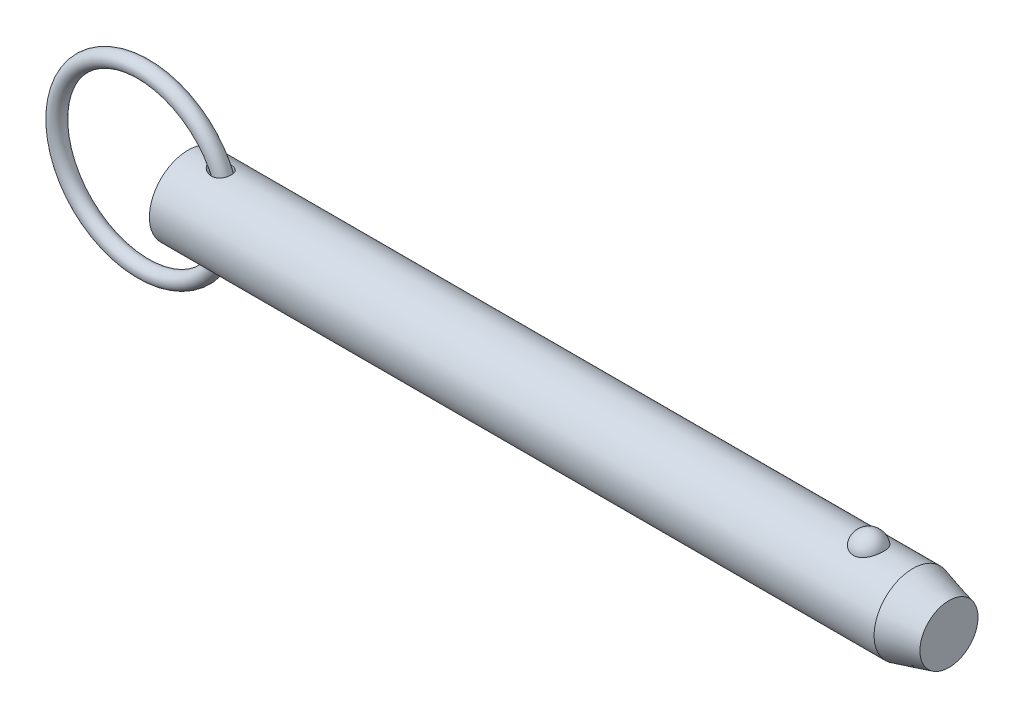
ISO-10303-21;
HEADER;
FILE_DESCRIPTION(('STEP AP214'),'2;1');
FILE_NAME('part.step','',(''),(''),'','','');
FILE_SCHEMA(('AUTOMOTIVE_DESIGN { 1 0 10303 214 1 1 1 1 }'));
ENDSEC;
DATA;
#1=APPLICATION_CONTEXT('core data for automotive mechanical design processes');
#2=APPLICATION_PROTOCOL_DEFINITION('international standard','automotive_design',2000,#1);
#3=PRODUCT_CONTEXT('',#1,'mechanical');
#4=PRODUCT('Part','Part','',(#3));
#5=PRODUCT_RELATED_PRODUCT_CATEGORY('part','',(#4));
#6=PRODUCT_DEFINITION_FORMATION('','',#4);
#7=PRODUCT_DEFINITION_CONTEXT('part definition',#1,'design');
#8=PRODUCT_DEFINITION('design','',#6,#7);
#9=PRODUCT_DEFINITION_SHAPE('','',#8);
#10=(LENGTH_UNIT() NAMED_UNIT(*) SI_UNIT(.MILLI.,.METRE.));
#11=(NAMED_UNIT(*) PLANE_ANGLE_UNIT() SI_UNIT($,.RADIAN.));
#12=(NAMED_UNIT(*) SI_UNIT($,.STERADIAN.) SOLID_ANGLE_UNIT());
#13=UNCERTAINTY_MEASURE_WITH_UNIT(LENGTH_MEASURE(1.E-05),#10,'distance_accuracy_value','');
#14=(GEOMETRIC_REPRESENTATION_CONTEXT(3) GLOBAL_UNCERTAINTY_ASSIGNED_CONTEXT((#13)) GLOBAL_UNIT_ASSIGNED_CONTEXT((#10,
#11,#12)) REPRESENTATION_CONTEXT('',''));
#15=CARTESIAN_POINT('',(0.,0.,0.));
#16=DIRECTION('',(0.,0.,1.));
#17=DIRECTION('',(1.,0.,0.));
#18=AXIS2_PLACEMENT_3D('',#15,#16,#17);
#19=CARTESIAN_POINT('',(-8.23730968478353,0.,0.));
#20=DIRECTION('',(0.,0.,1.));
#21=DIRECTION('',(1.,0.,0.));
#22=AXIS2_PLACEMENT_3D('',#19,#20,#21);
#23=TOROIDAL_SURFACE('',#22,15.875,1.422);
#24=CARTESIAN_POINT('',(9.05969031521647,0.,0.));
#25=VERTEX_POINT('',#24);
#26=VERTEX_LOOP('',#25);
#27=FACE_BOUND('',#26,.T.);
#28=ADVANCED_FACE('P0_F12',(#27),#23,.T.);
#29=CLOSED_SHELL('',(#28));
#30=MANIFOLD_SOLID_BREP('P0_B1',#29);
#31=CARTESIAN_POINT('',(0.,0.,0.));
#32=DIRECTION('',(1.,0.,0.));
#33=DIRECTION('',(0.,0.,-1.));
#34=AXIS2_PLACEMENT_3D('',#31,#32,#33);
#35=CYLINDRICAL_SURFACE('',#34,7.11);
#36=CARTESIAN_POINT('',(3.98467340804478,7.10072679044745,-0.363013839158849));
#37=CARTESIAN_POINT('',(4.00971652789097,7.09600153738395,-0.45539194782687));
#38=CARTESIAN_POINT('',(4.04401947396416,7.08958406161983,-0.545230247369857));
#39=CARTESIAN_POINT('',(4.12810160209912,7.07427055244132,-0.717157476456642));
#40=CARTESIAN_POINT('',(4.17791765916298,7.06536861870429,-0.799227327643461));
#41=CARTESIAN_POINT('',(4.28924471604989,7.04620300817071,-0.953469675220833));
#42=CARTESIAN_POINT('',(4.35063580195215,7.035953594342,-1.02573162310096));
#43=CARTESIAN_POINT('',(4.48282610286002,7.01493313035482,-1.16081412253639));
#44=CARTESIAN_POINT('',(4.55362244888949,7.00416223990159,-1.22363754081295));
#45=CARTESIAN_POINT('',(4.71659336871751,6.98090398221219,-1.35055080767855));
#46=CARTESIAN_POINT('',(4.81029272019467,6.96847103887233,-1.41269256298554));
#47=CARTESIAN_POINT('',(5.0057240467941,6.94515366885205,-1.52319699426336));
#48=CARTESIAN_POINT('',(5.10746392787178,6.93427079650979,-1.57154588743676));
#49=CARTESIAN_POINT('',(5.33503739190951,6.91346066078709,-1.66091325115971));
#50=CARTESIAN_POINT('',(5.46199550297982,6.90402388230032,-1.69921932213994));
#51=CARTESIAN_POINT('',(5.72084799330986,6.89024030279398,-1.75428261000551));
#52=CARTESIAN_POINT('',(5.85274301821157,6.88589416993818,-1.77103699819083));
#53=CARTESIAN_POINT('',(6.11557710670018,6.88337277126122,-1.78081990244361));
#54=CARTESIAN_POINT('',(6.24650031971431,6.88510489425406,-1.77420448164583));
#55=CARTESIAN_POINT('',(6.50446311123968,6.89478744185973,-1.73620392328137));
#56=CARTESIAN_POINT('',(6.6315075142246,6.90272978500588,-1.70485097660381));
#57=CARTESIAN_POINT('',(6.85933269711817,6.92243075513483,-1.62281888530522));
#58=CARTESIAN_POINT('',(6.96133251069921,6.93352131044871,-1.5753580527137));
#59=CARTESIAN_POINT('',(7.15436649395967,6.95824811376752,-1.46226310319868));
#60=CARTESIAN_POINT('',(7.24540699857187,6.97188287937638,-1.3966395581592));
#61=CARTESIAN_POINT('',(7.40446019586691,6.99838217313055,-1.25668991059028));
#62=CARTESIAN_POINT('',(7.473875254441,7.01118308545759,-1.18393777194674));
#63=CARTESIAN_POINT('',(7.59904891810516,7.03582803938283,-1.02736918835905));
#64=CARTESIAN_POINT('',(7.65481029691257,7.04767227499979,-0.943554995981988));
#65=CARTESIAN_POINT('',(7.74982438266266,7.06873077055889,-0.76979592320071));
#66=CARTESIAN_POINT('',(7.7894903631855,7.07800861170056,-0.680084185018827));
#67=CARTESIAN_POINT('',(7.85354088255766,7.09334756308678,-0.495102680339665));
#68=CARTESIAN_POINT('',(7.87792559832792,7.09940871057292,-0.399832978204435));
#69=CARTESIAN_POINT('',(7.9108898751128,7.10766731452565,-0.206294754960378));
#70=CARTESIAN_POINT('',(7.91944662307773,7.10985919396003,-0.108022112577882));
#71=CARTESIAN_POINT('',(7.920501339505,7.11012756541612,0.0886168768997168));
#72=CARTESIAN_POINT('',(7.91299895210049,7.10820396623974,0.186983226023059));
#73=CARTESIAN_POINT('',(7.88205794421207,7.10043733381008,0.381270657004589));
#74=CARTESIAN_POINT('',(7.85857985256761,7.09458459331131,0.477185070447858));
#75=CARTESIAN_POINT('',(7.79617406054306,7.07958431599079,0.663575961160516));
#76=CARTESIAN_POINT('',(7.75724672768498,7.07043685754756,0.754052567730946));
#77=CARTESIAN_POINT('',(7.66496731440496,7.04987259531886,0.926798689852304));
#78=CARTESIAN_POINT('',(7.61164530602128,7.0384605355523,1.00908483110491));
#79=CARTESIAN_POINT('',(7.49191707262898,7.01461776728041,1.16333092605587));
#80=CARTESIAN_POINT('',(7.42551210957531,7.00218715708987,1.235291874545));
#81=CARTESIAN_POINT('',(7.28164031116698,6.97770944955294,1.36680167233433));
#82=CARTESIAN_POINT('',(7.20420170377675,6.96566146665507,1.42638126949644));
#83=CARTESIAN_POINT('',(7.0403906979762,6.94319963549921,1.53199377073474));
#84=CARTESIAN_POINT('',(6.95401827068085,6.93278579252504,1.57802663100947));
#85=CARTESIAN_POINT('',(6.7731858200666,6.91444459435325,1.65656940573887));
#86=CARTESIAN_POINT('',(6.67860569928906,6.90656682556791,1.68881327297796));
#87=CARTESIAN_POINT('',(6.48544119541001,6.89422806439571,1.73849768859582));
#88=CARTESIAN_POINT('',(6.38685561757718,6.88976809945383,1.755933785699));
#89=CARTESIAN_POINT('',(6.18089829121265,6.88429907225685,1.77726234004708));
#90=CARTESIAN_POINT('',(6.07340937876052,6.88356485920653,1.78007646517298));
#91=CARTESIAN_POINT('',(5.85921220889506,6.886086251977,1.77029087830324));
#92=CARTESIAN_POINT('',(5.75250426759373,6.88934339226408,1.75768523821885));
#93=CARTESIAN_POINT('',(5.52848027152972,6.89994454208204,1.71563399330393));
#94=CARTESIAN_POINT('',(5.41155168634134,6.90775772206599,1.68424184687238));
#95=CARTESIAN_POINT('',(5.18376466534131,6.92670168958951,1.60454711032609));
#96=CARTESIAN_POINT('',(5.07291446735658,6.9378368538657,1.5562221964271));
#97=CARTESIAN_POINT('',(4.84835244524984,6.96347168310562,1.43744827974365));
#98=CARTESIAN_POINT('',(4.73562531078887,6.97820486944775,1.36517310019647));
#99=CARTESIAN_POINT('',(4.52504912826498,7.00822340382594,1.20158053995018));
#100=CARTESIAN_POINT('',(4.42717478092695,7.02350775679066,1.11029618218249));
#101=CARTESIAN_POINT('',(4.27935716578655,7.04784659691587,0.940654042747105));
#102=CARTESIAN_POINT('',(4.2239722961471,7.05736064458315,0.867099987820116));
#103=CARTESIAN_POINT('',(4.12558347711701,7.07469854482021,0.711919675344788));
#104=CARTESIAN_POINT('',(4.08256922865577,7.0825238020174,0.630300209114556));
#105=CARTESIAN_POINT('',(4.01142860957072,7.09565978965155,0.459428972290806));
#106=CARTESIAN_POINT('',(3.98346043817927,7.10094374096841,0.370107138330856));
#107=CARTESIAN_POINT('',(3.95517285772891,7.1063173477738,0.233358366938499));
#108=CARTESIAN_POINT('',(3.94802115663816,7.1076831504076,0.187321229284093));
#109=CARTESIAN_POINT('',(3.93842121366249,7.10951900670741,0.0947476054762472));
#110=CARTESIAN_POINT('',(3.93597129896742,7.10998937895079,0.0482113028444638));
#111=CARTESIAN_POINT('',(3.93584361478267,7.11001358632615,-0.0598597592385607));
#112=CARTESIAN_POINT('',(3.9399538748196,7.10922402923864,-0.121405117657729));
#113=CARTESIAN_POINT('',(3.95632793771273,7.10609781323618,-0.243320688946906));
#114=CARTESIAN_POINT('',(3.96859135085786,7.10376122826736,-0.303690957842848));
#115=CARTESIAN_POINT('',(3.98467340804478,7.10072679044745,-0.363013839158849));
#116=B_SPLINE_CURVE_WITH_KNOTS('',3,(#36,#37,#38,#39,#40,#41,#42,#43,#44,#45,#46,#47,#48,#49,
#50,#51,#52,#53,#54,#55,#56,#57,#58,#59,#60,#61,#62,#63,#64,#65,#66,#67,#68,#69,#70,#71,#72,#73,
#74,#75,#76,#77,#78,#79,#80,#81,#82,#83,#84,#85,#86,#87,#88,#89,#90,#91,#92,#93,#94,#95,#96,#97,
#98,#99,#100,#101,#102,#103,#104,#105,#106,#107,#108,#109,#110,#111,#112,#113,#114,#115),
.UNSPECIFIED.,.T.,.F.,(4,2,2,2,2,2,2,2,2,2,2,2,2,2,2,2,2,2,2,2,2,2,2,2,2,2,2,2,2,2,2,2,2,2,2,2,
2,2,2,4),(0.,0.287206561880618,0.575101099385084,0.860162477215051,1.14513709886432,
1.48324846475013,1.82169652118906,2.21865672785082,2.6156690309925,3.00665870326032,
3.39714041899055,3.73437585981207,4.07141541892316,4.37402271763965,4.67656849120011,
4.97076150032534,5.26495110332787,5.55956439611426,5.85418421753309,6.14953461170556,
6.44487798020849,6.73960905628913,7.03431171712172,7.32827352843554,7.6222362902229,
7.9216396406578,8.22113296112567,8.54242840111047,8.86384740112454,9.22635035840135,
9.58933304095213,9.99153142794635,10.3930368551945,10.6697219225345,10.9461759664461,
11.2254825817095,11.3650959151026,11.5046595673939,11.6891051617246,11.8735419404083),.UNSPECIFIED.);
#117=CARTESIAN_POINT('',(3.98467340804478,7.10072679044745,-0.363013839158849));
#118=VERTEX_POINT('',#117);
#119=EDGE_CURVE('P1_E40',#118,#118,#116,.T.);
#120=ORIENTED_EDGE('',*,*,#119,.T.);
#121=EDGE_LOOP('',(#120));
#122=FACE_BOUND('',#121,.T.);
#123=CARTESIAN_POINT('',(133.036279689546,0.,0.));
#124=DIRECTION('',(1.,0.,0.));
#125=DIRECTION('',(0.,0.,-1.));
#126=AXIS2_PLACEMENT_3D('',#123,#124,#125);
#127=CIRCLE('',#126,7.11);
#128=CARTESIAN_POINT('',(133.036279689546,0.,-7.11));
#129=VERTEX_POINT('',#128);
#130=EDGE_CURVE('P1_E25',#129,#129,#127,.T.);
#131=ORIENTED_EDGE('',*,*,#130,.F.);
#132=EDGE_LOOP('',(#131));
#133=FACE_BOUND('',#132,.T.);
#134=CARTESIAN_POINT('',(0.,0.,0.));
#135=DIRECTION('',(1.,0.,0.));
#136=DIRECTION('',(0.,0.,-1.));
#137=AXIS2_PLACEMENT_3D('',#134,#135,#136);
#138=CIRCLE('',#137,7.11);
#139=CARTESIAN_POINT('',(0.,0.,-7.11));
#140=VERTEX_POINT('',#139);
#141=EDGE_CURVE('P1_E9',#140,#140,#138,.T.);
#142=ORIENTED_EDGE('',*,*,#141,.T.);
#143=EDGE_LOOP('',(#142));
#144=FACE_BOUND('',#143,.T.);
#145=CARTESIAN_POINT('',(124.929258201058,6.53646663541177,2.79762469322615));
#146=CARTESIAN_POINT('',(124.784429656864,6.53647876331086,2.79761243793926));
#147=CARTESIAN_POINT('',(124.639368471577,6.54144531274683,2.7860811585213));
#148=CARTESIAN_POINT('',(124.353292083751,6.56077791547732,2.74023282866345));
#149=CARTESIAN_POINT('',(124.21228845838,6.57516852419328,2.70585624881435));
#150=CARTESIAN_POINT('',(123.93888335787,6.61165072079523,2.61544042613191));
#151=CARTESIAN_POINT('',(123.806460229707,6.63372195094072,2.55945840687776));
#152=CARTESIAN_POINT('',(123.553233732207,6.68316012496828,2.4274295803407));
#153=CARTESIAN_POINT('',(123.432425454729,6.71052481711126,2.35139129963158));
#154=CARTESIAN_POINT('',(123.201637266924,6.76860821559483,2.17866150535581));
#155=CARTESIAN_POINT('',(123.092085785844,6.79940242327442,2.08142342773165));
#156=CARTESIAN_POINT('',(122.89033404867,6.86050242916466,1.87020907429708));
#157=CARTESIAN_POINT('',(122.798139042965,6.89080807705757,1.75622775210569));
#158=CARTESIAN_POINT('',(122.62925478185,6.94923069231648,1.50900646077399));
#159=CARTESIAN_POINT('',(122.553428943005,6.97719213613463,1.37513873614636));
#160=CARTESIAN_POINT('',(122.424206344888,7.02647251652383,1.09584817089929));
#161=CARTESIAN_POINT('',(122.370810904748,7.04779106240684,0.950424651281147));
#162=CARTESIAN_POINT('',(122.287101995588,7.08180248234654,0.650508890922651));
#163=CARTESIAN_POINT('',(122.257025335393,7.09440672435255,0.495940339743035));
#164=CARTESIAN_POINT('',(122.221473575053,7.10935121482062,0.183515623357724));
#165=CARTESIAN_POINT('',(122.215997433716,7.11169189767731,0.0256595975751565));
#166=CARTESIAN_POINT('',(122.229700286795,7.10589702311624,-0.287512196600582));
#167=CARTESIAN_POINT('',(122.24868231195,7.0978451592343,-0.442838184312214));
#168=CARTESIAN_POINT('',(122.31057450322,7.07221860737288,-0.747830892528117));
#169=CARTESIAN_POINT('',(122.353485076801,7.05464375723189,-0.897497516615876));
#170=CARTESIAN_POINT('',(122.462452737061,7.01171031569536,-1.18722864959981));
#171=CARTESIAN_POINT('',(122.528545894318,6.98633960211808,-1.32727778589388));
#172=CARTESIAN_POINT('',(122.682536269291,6.93042258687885,-1.59370324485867));
#173=CARTESIAN_POINT('',(122.770435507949,6.89987580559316,-1.72007829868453));
#174=CARTESIAN_POINT('',(122.966926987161,6.83659510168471,-1.95657345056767));
#175=CARTESIAN_POINT('',(123.075664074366,6.80384697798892,-2.06656957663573));
#176=CARTESIAN_POINT('',(123.310968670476,6.74001831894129,-2.26611005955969));
#177=CARTESIAN_POINT('',(123.437535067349,6.7089376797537,-2.35565569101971));
#178=CARTESIAN_POINT('',(123.702845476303,6.65264442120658,-2.51019726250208));
#179=CARTESIAN_POINT('',(123.841323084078,6.62733449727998,-2.57561395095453));
#180=CARTESIAN_POINT('',(124.128519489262,6.58495995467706,-2.68211134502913));
#181=CARTESIAN_POINT('',(124.277234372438,6.56789220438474,-2.72320129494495));
#182=CARTESIAN_POINT('',(124.572626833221,6.54478663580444,-2.77825810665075));
#183=CARTESIAN_POINT('',(124.71902951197,6.53823639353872,-2.79348727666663));
#184=CARTESIAN_POINT('',(125.012470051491,6.53532718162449,-2.80028921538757));
#185=CARTESIAN_POINT('',(125.159507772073,6.538966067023,-2.79186696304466));
#186=CARTESIAN_POINT('',(125.444921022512,6.55570357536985,-2.75232178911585));
#187=CARTESIAN_POINT('',(125.583422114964,6.56848455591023,-2.72196077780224));
#188=CARTESIAN_POINT('',(125.853114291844,6.60173528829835,-2.64028774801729));
#189=CARTESIAN_POINT('',(125.984304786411,6.6222056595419,-2.58897404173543));
#190=CARTESIAN_POINT('',(126.238846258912,6.66917927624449,-2.46547820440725));
#191=CARTESIAN_POINT('',(126.361969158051,6.69580233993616,-2.39287266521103));
#192=CARTESIAN_POINT('',(126.594441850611,6.75207041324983,-2.22915269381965));
#193=CARTESIAN_POINT('',(126.703788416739,6.78171612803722,-2.13803393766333));
#194=CARTESIAN_POINT('',(126.911642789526,6.8426462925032,-1.93445592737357));
#195=CARTESIAN_POINT('',(127.009317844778,6.8739374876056,-1.82114774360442));
#196=CARTESIAN_POINT('',(127.185011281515,6.93345710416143,-1.57947787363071));
#197=CARTESIAN_POINT('',(127.263026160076,6.96168497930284,-1.45111351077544));
#198=CARTESIAN_POINT('',(127.399985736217,7.0130755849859,-1.17842708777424));
#199=CARTESIAN_POINT('',(127.458258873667,7.03605262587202,-1.03373189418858));
#200=CARTESIAN_POINT('',(127.551081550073,7.07340932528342,-0.735867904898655));
#201=CARTESIAN_POINT('',(127.585631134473,7.08778900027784,-0.582699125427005));
#202=CARTESIAN_POINT('',(127.630274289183,7.10647639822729,-0.27242066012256));
#203=CARTESIAN_POINT('',(127.64039710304,7.11079616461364,-0.115315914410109));
#204=CARTESIAN_POINT('',(127.636061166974,7.10896059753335,0.198488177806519));
#205=CARTESIAN_POINT('',(127.621603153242,7.10280557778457,0.355187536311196));
#206=CARTESIAN_POINT('',(127.568572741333,7.08071500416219,0.662724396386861));
#207=CARTESIAN_POINT('',(127.53015058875,7.06484039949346,0.813592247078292));
#208=CARTESIAN_POINT('',(127.430101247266,7.0249589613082,1.10629159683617));
#209=CARTESIAN_POINT('',(127.368472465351,7.00095156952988,1.24812247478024));
#210=CARTESIAN_POINT('',(127.222766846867,6.94706632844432,1.51976439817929));
#211=CARTESIAN_POINT('',(127.138544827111,6.91715085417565,1.64949012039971));
#212=CARTESIAN_POINT('',(126.949586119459,6.85470565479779,1.8923128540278));
#213=CARTESIAN_POINT('',(126.844850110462,6.82217601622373,2.00541041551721));
#214=CARTESIAN_POINT('',(126.617103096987,6.75805358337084,2.21190674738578));
#215=CARTESIAN_POINT('',(126.494082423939,6.72646129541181,2.30529503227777));
#216=CARTESIAN_POINT('',(126.23273470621,6.66789520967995,2.46959908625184));
#217=CARTESIAN_POINT('',(126.094401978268,6.64092313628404,2.54050647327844));
#218=CARTESIAN_POINT('',(125.811182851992,6.59572583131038,2.65560045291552));
#219=CARTESIAN_POINT('',(125.666666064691,6.57724013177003,2.70059539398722));
#220=CARTESIAN_POINT('',(125.371546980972,6.55006426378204,2.76587321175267));
#221=CARTESIAN_POINT('',(125.220964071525,6.54134511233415,2.78622922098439));
#222=CARTESIAN_POINT('',(125.023046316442,6.53697847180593,2.79642434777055));
#223=CARTESIAN_POINT('',(124.976164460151,6.53646270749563,2.79762866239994));
#224=CARTESIAN_POINT('',(124.929258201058,6.53646663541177,2.79762469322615));
#225=B_SPLINE_CURVE_WITH_KNOTS('',3,(#145,#146,#147,#148,#149,#150,#151,#152,#153,#154,#155,
#156,#157,#158,#159,#160,#161,#162,#163,#164,#165,#166,#167,#168,#169,#170,#171,#172,#173,#174,
#175,#176,#177,#178,#179,#180,#181,#182,#183,#184,#185,#186,#187,#188,#189,#190,#191,#192,#193,
#194,#195,#196,#197,#198,#199,#200,#201,#202,#203,#204,#205,#206,#207,#208,#209,#210,#211,#212,
#213,#214,#215,#216,#217,#218,#219,#220,#221,#222,#223,#224),.UNSPECIFIED.,.T.,.F.,(4,2,2,2,2,2,
2,2,2,2,2,2,2,2,2,2,2,2,2,2,2,2,2,2,2,2,2,2,2,2,2,2,2,2,2,2,2,2,2,4),(0.,0.434355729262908,
0.869847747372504,1.30419416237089,1.738356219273,2.18541922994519,2.63261726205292,
3.0995426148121,3.56649542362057,4.03813031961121,4.5097452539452,4.97758575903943,
5.44543423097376,5.91401389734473,6.38263700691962,6.85464418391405,7.32662193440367,
7.78992971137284,8.25306131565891,8.69285754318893,9.13256119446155,9.55768625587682,
9.98284556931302,10.417110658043,10.8514772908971,11.3079089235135,11.7644218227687,
12.2351898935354,12.7059570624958,13.1761603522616,13.6463495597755,14.113620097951,
14.5809227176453,15.0513032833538,15.5216682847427,15.9922828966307,16.4630727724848,
16.9182457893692,17.3720644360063,17.5127411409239),.UNSPECIFIED.);
#226=CARTESIAN_POINT('',(124.929258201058,6.53646663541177,2.79762469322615));
#227=VERTEX_POINT('',#226);
#228=EDGE_CURVE('P1_E34',#227,#227,#225,.T.);
#229=ORIENTED_EDGE('',*,*,#228,.T.);
#230=EDGE_LOOP('',(#229));
#231=FACE_BOUND('',#230,.T.);
#232=CARTESIAN_POINT('',(3.98467340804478,-7.10072679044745,-0.363013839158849));
#233=CARTESIAN_POINT('',(3.96426456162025,-7.10457733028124,-0.287714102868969));
#234=CARTESIAN_POINT('',(3.95000501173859,-7.10730349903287,-0.210695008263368));
#235=CARTESIAN_POINT('',(3.93481801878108,-7.11020840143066,-0.0553038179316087));
#236=CARTESIAN_POINT('',(3.93388435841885,-7.11038832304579,0.0230676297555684));
#237=CARTESIAN_POINT('',(3.94541910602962,-7.10817995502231,0.178714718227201));
#238=CARTESIAN_POINT('',(3.95787987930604,-7.10579312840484,0.25599095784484));
#239=CARTESIAN_POINT('',(3.99523775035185,-7.09872642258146,0.407352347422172));
#240=CARTESIAN_POINT('',(4.02014065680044,-7.09404547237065,0.481435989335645));
#241=CARTESIAN_POINT('',(4.08119600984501,-7.08278363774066,0.625775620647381));
#242=CARTESIAN_POINT('',(4.11749458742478,-7.07617815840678,0.695967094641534));
#243=CARTESIAN_POINT('',(4.19940836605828,-7.06165305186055,0.830508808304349));
#244=CARTESIAN_POINT('',(4.24502952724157,-7.0537325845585,0.894855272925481));
#245=CARTESIAN_POINT('',(4.36790232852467,-7.03310314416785,1.04688574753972));
#246=CARTESIAN_POINT('',(4.44977459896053,-7.01993229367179,1.13078695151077));
#247=CARTESIAN_POINT('',(4.62610796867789,-6.99351259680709,1.28411726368));
#248=CARTESIAN_POINT('',(4.7205898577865,-6.98026365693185,1.35352197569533));
#249=CARTESIAN_POINT('',(4.92036507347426,-6.9549104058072,1.47831921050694));
#250=CARTESIAN_POINT('',(5.02579054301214,-6.94282458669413,1.53350332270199));
#251=CARTESIAN_POINT('',(5.24378330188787,-6.92129098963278,1.62793610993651));
#252=CARTESIAN_POINT('',(5.35635066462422,-6.91184323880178,1.66718462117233));
#253=CARTESIAN_POINT('',(5.60134354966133,-6.89573491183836,1.73269893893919));
#254=CARTESIAN_POINT('',(5.73444697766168,-6.8895970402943,1.75661057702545));
#255=CARTESIAN_POINT('',(6.00300738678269,-6.88344616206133,1.78057487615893));
#256=CARTESIAN_POINT('',(6.13846360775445,-6.88343121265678,1.78063510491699));
#257=CARTESIAN_POINT('',(6.39660470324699,-6.88981379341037,1.75576480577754));
#258=CARTESIAN_POINT('',(6.51947843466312,-6.89572457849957,1.73273121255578));
#259=CARTESIAN_POINT('',(6.75813770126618,-6.91274434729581,1.66352936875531));
#260=CARTESIAN_POINT('',(6.87393155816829,-6.92384709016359,1.61738888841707));
#261=CARTESIAN_POINT('',(7.07801861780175,-6.94787316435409,1.51052664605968));
#262=CARTESIAN_POINT('',(7.16789841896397,-6.96033024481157,1.45271574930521));
#263=CARTESIAN_POINT('',(7.33546773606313,-6.98638661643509,1.32171912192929));
#264=CARTESIAN_POINT('',(7.41316182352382,-6.99998547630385,1.24853918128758));
#265=CARTESIAN_POINT('',(7.54861420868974,-7.02559503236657,1.09486170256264));
#266=CARTESIAN_POINT('',(7.60741145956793,-7.03764930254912,1.01528346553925));
#267=CARTESIAN_POINT('',(7.71070740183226,-7.0598657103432,0.847099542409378));
#268=CARTESIAN_POINT('',(7.75520788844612,-7.0700280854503,0.758494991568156));
#269=CARTESIAN_POINT('',(7.82836147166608,-7.08722075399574,0.575936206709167));
#270=CARTESIAN_POINT('',(7.85719783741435,-7.09428707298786,0.482058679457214));
#271=CARTESIAN_POINT('',(7.89918378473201,-7.10470260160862,0.29065874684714));
#272=CARTESIAN_POINT('',(7.91233308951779,-7.10805174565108,0.193136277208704));
#273=CARTESIAN_POINT('',(7.92267451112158,-7.11067890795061,-0.00313968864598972));
#274=CARTESIAN_POINT('',(7.91981203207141,-7.10994299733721,-0.10189624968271));
#275=CARTESIAN_POINT('',(7.89806489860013,-7.10444651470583,-0.297516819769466));
#276=CARTESIAN_POINT('',(7.87918005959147,-7.09968589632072,-0.394380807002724));
#277=CARTESIAN_POINT('',(7.82577988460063,-7.0866471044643,-0.58355375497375));
#278=CARTESIAN_POINT('',(7.79124976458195,-7.07836560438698,-0.675858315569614));
#279=CARTESIAN_POINT('',(7.70736343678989,-7.05919003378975,-0.853167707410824));
#280=CARTESIAN_POINT('',(7.65800801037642,-7.04829610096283,-0.938172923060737));
#281=CARTESIAN_POINT('',(7.54590141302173,-7.02513961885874,-1.09819812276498));
#282=CARTESIAN_POINT('',(7.48319521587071,-7.01288172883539,-1.17325029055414));
#283=CARTESIAN_POINT('',(7.34599775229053,-6.98832192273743,-1.31164333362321));
#284=CARTESIAN_POINT('',(7.27150757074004,-6.97602001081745,-1.37498528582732));
#285=CARTESIAN_POINT('',(7.11277776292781,-6.95268608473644,-1.48849974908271));
#286=CARTESIAN_POINT('',(7.02852525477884,-6.94165578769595,-1.53865456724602));
#287=CARTESIAN_POINT('',(6.85282430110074,-6.92200320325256,-1.62478650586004));
#288=CARTESIAN_POINT('',(6.76137511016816,-6.91338116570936,-1.66076215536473));
#289=CARTESIAN_POINT('',(6.57061179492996,-6.89906044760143,-1.71930563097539));
#290=CARTESIAN_POINT('',(6.47113516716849,-6.89347290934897,-1.74136795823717));
#291=CARTESIAN_POINT('',(6.26989833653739,-6.88605020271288,-1.7704895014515));
#292=CARTESIAN_POINT('',(6.16813737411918,-6.88421630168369,-1.77754365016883));
#293=CARTESIAN_POINT('',(5.95492537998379,-6.88424071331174,-1.77745174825));
#294=CARTESIAN_POINT('',(5.8434768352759,-6.88646827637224,-1.76888555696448));
#295=CARTESIAN_POINT('',(5.62307560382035,-6.89483827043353,-1.73596677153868));
#296=CARTESIAN_POINT('',(5.51412477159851,-6.90098351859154,-1.71160281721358));
#297=CARTESIAN_POINT('',(5.28644478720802,-6.91743803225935,-1.64393691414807));
#298=CARTESIAN_POINT('',(5.16837217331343,-6.92819628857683,-1.59852806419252));
#299=CARTESIAN_POINT('',(4.94091825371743,-6.95234836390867,-1.4899796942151));
#300=CARTESIAN_POINT('',(4.83153887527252,-6.96574276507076,-1.42683625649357));
#301=CARTESIAN_POINT('',(4.63576710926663,-6.99209234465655,-1.29112257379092));
#302=CARTESIAN_POINT('',(4.54816728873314,-7.00494184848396,-1.22027748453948));
#303=CARTESIAN_POINT('',(4.38554897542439,-7.03019055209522,-1.0652111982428));
#304=CARTESIAN_POINT('',(4.31052141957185,-7.04259007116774,-0.980999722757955));
#305=CARTESIAN_POINT('',(4.18551811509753,-7.0640229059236,-0.811206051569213));
#306=CARTESIAN_POINT('',(4.13358417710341,-7.07328321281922,-0.727107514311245));
#307=CARTESIAN_POINT('',(4.04607461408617,-7.0891994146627,-0.550580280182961));
#308=CARTESIAN_POINT('',(4.01046401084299,-7.09586087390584,-0.458169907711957));
#309=CARTESIAN_POINT('',(3.98467340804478,-7.10072679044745,-0.363013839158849));
#310=B_SPLINE_CURVE_WITH_KNOTS('',3,(#232,#233,#234,#235,#236,#237,#238,#239,#240,#241,#242,
#243,#244,#245,#246,#247,#248,#249,#250,#251,#252,#253,#254,#255,#256,#257,#258,#259,#260,#261,
#262,#263,#264,#265,#266,#267,#268,#269,#270,#271,#272,#273,#274,#275,#276,#277,#278,#279,#280,
#281,#282,#283,#284,#285,#286,#287,#288,#289,#290,#291,#292,#293,#294,#295,#296,#297,#298,#299,
#300,#301,#302,#303,#304,#305,#306,#307,#308,#309),.UNSPECIFIED.,.T.,.F.,(4,2,2,2,2,2,2,2,2,2,2,
2,2,2,2,2,2,2,2,2,2,2,2,2,2,2,2,2,2,2,2,2,2,2,2,2,2,2,4),(0.,0.23402065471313,0.467932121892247,
0.701710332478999,0.935597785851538,1.17261620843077,1.40978663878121,1.76177576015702,
2.11435255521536,2.47183528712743,2.8293216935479,3.23332937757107,3.63720887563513,
4.01042610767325,4.38319587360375,4.70425151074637,5.02518641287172,5.32277979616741,
5.62033579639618,5.91433101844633,6.2083314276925,6.50333490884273,6.79834178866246,
7.09362801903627,7.38889868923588,7.6831900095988,7.9774542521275,8.27211131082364,
8.56679892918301,8.8716552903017,9.17661456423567,9.51069129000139,9.84500851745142,
10.2243046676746,10.6036846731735,10.9425776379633,11.2812252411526,11.5775945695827,
11.8733258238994),.UNSPECIFIED.);
#311=CARTESIAN_POINT('',(3.98467340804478,-7.10072679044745,-0.363013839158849));
#312=VERTEX_POINT('',#311);
#313=EDGE_CURVE('P1_E17',#312,#312,#310,.T.);
#314=ORIENTED_EDGE('',*,*,#313,.T.);
#315=EDGE_LOOP('',(#314));
#316=FACE_BOUND('',#315,.T.);
#317=ADVANCED_FACE('P1_F13',(#122,#133,#144,#231,#316),#35,.T.);
#318=CARTESIAN_POINT('',(0.,0.,0.));
#319=DIRECTION('',(-1.,0.,0.));
#320=DIRECTION('',(0.,0.,1.));
#321=AXIS2_PLACEMENT_3D('',#318,#319,#320);
#322=PLANE('',#321);
#323=ORIENTED_EDGE('',*,*,#141,.F.);
#324=EDGE_LOOP('',(#323));
#325=FACE_BOUND('',#324,.T.);
#326=ADVANCED_FACE('P1_F15',(#325),#322,.T.);
#327=CARTESIAN_POINT('',(139.67,0.,0.));
#328=DIRECTION('',(-1.,0.,0.));
#329=DIRECTION('',(0.,0.,1.));
#330=AXIS2_PLACEMENT_3D('',#327,#328,#329);
#331=CONICAL_SURFACE('',#330,5.33250000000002,0.26179938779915);
#332=ORIENTED_EDGE('',*,*,#130,.T.);
#333=EDGE_LOOP('',(#332));
#334=FACE_BOUND('',#333,.T.);
#335=CARTESIAN_POINT('',(139.67,0.,0.));
#336=DIRECTION('',(1.,0.,0.));
#337=DIRECTION('',(0.,0.,-1.));
#338=AXIS2_PLACEMENT_3D('',#335,#336,#337);
#339=CIRCLE('',#338,5.33250000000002);
#340=CARTESIAN_POINT('',(139.67,0.,-5.33250000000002));
#341=VERTEX_POINT('',#340);
#342=EDGE_CURVE('P1_E30',#341,#341,#339,.T.);
#343=ORIENTED_EDGE('',*,*,#342,.F.);
#344=EDGE_LOOP('',(#343));
#345=FACE_BOUND('',#344,.T.);
#346=ADVANCED_FACE('P1_F55',(#334,#345),#331,.T.);
#347=CARTESIAN_POINT('',(139.67,5.33250000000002,0.));
#348=DIRECTION('',(1.,0.,0.));
#349=DIRECTION('',(0.,0.,-1.));
#350=AXIS2_PLACEMENT_3D('',#347,#348,#349);
#351=PLANE('',#350);
#352=ORIENTED_EDGE('',*,*,#342,.T.);
#353=EDGE_LOOP('',(#352));
#354=FACE_BOUND('',#353,.T.);
#355=ADVANCED_FACE('P1_F51',(#354),#351,.T.);
#356=CARTESIAN_POINT('',(124.929258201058,6.399,0.));
#357=DIRECTION('',(-1.,0.,0.));
#358=DIRECTION('',(0.,-1.,0.));
#359=AXIS2_PLACEMENT_3D('',#356,#357,#358);
#360=SPHERICAL_SURFACE('',#359,2.80100000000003);
#361=ORIENTED_EDGE('',*,*,#228,.F.);
#362=EDGE_LOOP('',(#361));
#363=FACE_BOUND('',#362,.T.);
#364=ADVANCED_FACE('P1_F46',(#363),#360,.T.);
#365=CARTESIAN_POINT('',(-8.23730968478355,0.,0.));
#366=DIRECTION('',(0.,0.,1.));
#367=DIRECTION('',(1.,0.,0.));
#368=AXIS2_PLACEMENT_3D('',#365,#366,#367);
#369=TOROIDAL_SURFACE('',#368,15.875,1.7775);
#370=ORIENTED_EDGE('',*,*,#313,.F.);
#371=EDGE_LOOP('',(#370));
#372=FACE_BOUND('',#371,.T.);
#373=ORIENTED_EDGE('',*,*,#119,.F.);
#374=EDGE_LOOP('',(#373));
#375=FACE_BOUND('',#374,.T.);
#376=ADVANCED_FACE('P1_F50',(#372,#375),#369,.F.);
#377=CLOSED_SHELL('',(#317,#326,#346,#355,#364,#376));
#378=MANIFOLD_SOLID_BREP('P1_B1',#377);
#379=ADVANCED_BREP_SHAPE_REPRESENTATION('',(#18,#30,#378),#14);
#380=SHAPE_DEFINITION_REPRESENTATION(#9,#379);
ENDSEC;
END-ISO-10303-21;
